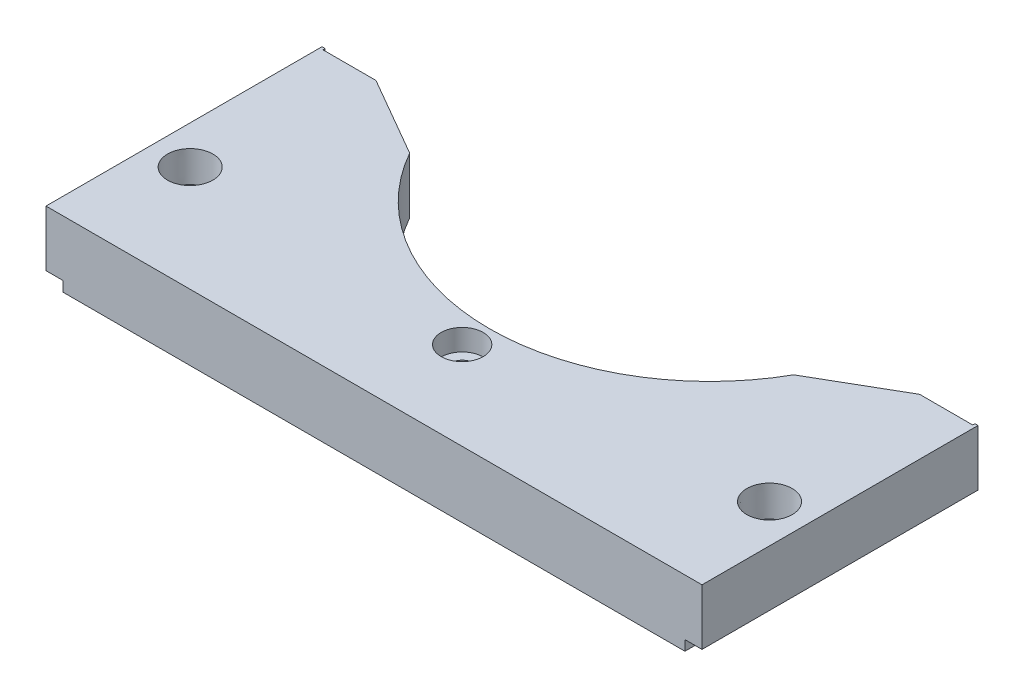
from build123d import *

# Parameters (mm, degrees)
SKETCH3_W                                       = 147.43505
SKETCH3_H                                       = 62.112
EXTRUDE1_DEPTH                                  = 12.7
EXTRUDE2_REACH                                  = 82.994
EXTRUDE6_START                                  = -12.7
EXTRUDE6_DEPTH                                  = 12.7
EXTRUDE4_DEPTH                                  = 2.3
EXTRUDE5_DEPTH                                  = 2.3
CBORE_FOR_10_SOCKET_HEAD_CAP_SCREW1_D           = 4.9784
CBORE_FOR_10_SOCKET_HEAD_CAP_SCREW1_CBORE_D     = 9.525
CBORE_FOR_10_SOCKET_HEAD_CAP_SCREW1_CBORE_DEPTH = 4.826
EXTRUDE7_DEPTH                                  = 1
EXTRUDE8_DEPTH                                  = 0.5
SKETCH14_W                                      = 62.612
SKETCH14_H                                      = 12.7
EXTRUDE10_DEPTH                                 = 0.7


with BuildPart() as part:
    # Sketch3 → Extrude1 (new body)
    with BuildSketch(Plane(origin=(0, 0, 0), x_dir=(1, 0, 0), z_dir=(0, 1, 0))):
        Rectangle(SKETCH3_W, SKETCH3_H)
    extrude(amount=EXTRUDE1_DEPTH)

    # Sketch4 → Extrude2 (cut, up to next)
    with BuildSketch(Plane(origin=(0, 12.7, 0), x_dir=(1, 0, 0), z_dir=(0, 1, 0)), mode=Mode.PRIVATE) as extrude2_sk1:
        with BuildLine():
            Line((-50, 45.1435), (50, 45.1435))
            ThreePointArc((50, 45.1435), (0, -4.8565), (-50, 45.1435))
        make_face()
    extrude2_tool1 = extrude(extrude2_sk1.sketch, amount=-EXTRUDE2_REACH, mode=Mode.PRIVATE) & part.part
    add(extrude2_tool1.solids().sort_by_distance((0, 12.7, -23.922841))[0], mode=Mode.SUBTRACT)

    # Sketch9 → Extrude6 (cut)
    with BuildSketch(Plane(origin=(0, 12.7, 0), x_dir=(1, 0, 0), z_dir=(0, 1, 0)).offset(EXTRUDE6_START)):
        Polygon((-61.673025, 31.056), (0, -4.550937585), (61.673025, 31.056), align=None)
    extrude(amount=EXTRUDE6_DEPTH, mode=Mode.SUBTRACT)

    # Sketch6 → Extrude4 (add)
    with BuildSketch(Plane.XZ):
        with BuildLine():
            Line((-70.542525, 31.056), (70.542525, 31.056))
            Line((70.542525, 31.056), (70.542525, -27.881))
            Line((70.542525, -27.881), (62.523763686, -27.881))
            Line((62.523763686, -27.881), (45.888455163, -18.276600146))
            ThreePointArc((45.888455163, -18.276600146), (0, 8.0315), (-45.888455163, -18.276600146))
            Line((-45.888455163, -18.276600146), (-62.523763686, -27.881))
            Line((-62.523763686, -27.881), (-70.542525, -27.881))
            Line((-70.542525, -27.881), (-70.542525, 31.056))
        make_face()
    extrude(amount=EXTRUDE4_DEPTH)

    # Sketch7 → Extrude5 (cut)
    with BuildSketch(Plane.XZ.offset(2.3)):
        with BuildLine():
            Line((47.625, 5.657), (47.625, -31.056))
            Line((47.625, -31.056), (53.975, -31.056))
            Line((53.975, -31.056), (53.975, 5.657))
            ThreePointArc((53.975, 5.657), (50.8, 8.832), (47.625, 5.657))
        make_face()
        with BuildLine():
            Line((-53.975, 5.657), (-53.975, -31.056))
            Line((-53.975, -31.056), (-47.625, -31.056))
            Line((-47.625, -31.056), (-47.625, 5.657))
            ThreePointArc((-47.625, 5.657), (-50.8, 8.832), (-53.975, 5.657))
        make_face()
    extrude(amount=-EXTRUDE5_DEPTH, mode=Mode.SUBTRACT)

    # CBORE for _10 Socket Head Cap Screw1 (through all)
    with Locations(Plane(origin=(0, 12.7, 11.056), x_dir=(0, 0, 1), z_dir=(0, 1, 0))):
        with Locations((0, 0)):
            CounterBoreHole(CBORE_FOR_10_SOCKET_HEAD_CAP_SCREW1_D / 2, CBORE_FOR_10_SOCKET_HEAD_CAP_SCREW1_CBORE_D / 2, CBORE_FOR_10_SOCKET_HEAD_CAP_SCREW1_CBORE_DEPTH)

    # Sketch10 → Extrude7 (cut)
    with BuildSketch(Plane(origin=(0, 0, -31.056), x_dir=(-1, 0, 0), z_dir=(0, 0, -1))):
        with BuildLine():
            Line((-70.746234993, 0), (-72.688815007, 0))
            Line((-72.688815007, 0), (-72.46706812, 6.35))
            ThreePointArc((-72.46706812, 6.35), (-71.717525, 7.073825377), (-70.96798188, 6.35))
            Line((-70.96798188, 6.35), (-70.746234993, 0))
        make_face()
    extrude7 = extrude(amount=-EXTRUDE7_DEPTH, mode=Mode.SUBTRACT)

    # Sketch11 → Extrude8 (cut)
    with BuildSketch(Plane(origin=(0, 0, -31.056), x_dir=(-1, 0, 0), z_dir=(0, 0, -1))):
        with BuildLine():
            Line((-68.323775, 11.9), (-67.066775, 11.9))
            ThreePointArc((-67.066775, 11.9), (-66.505508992, 11.667516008), (-66.273025, 11.10625))
            Line((-66.273025, 11.10625), (-66.273025, 10.5806))
            ThreePointArc((-66.273025, 10.5806), (-66.033178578, 9.737995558), (-65.385547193, 9.148010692))
            ThreePointArc((-65.385547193, 9.148010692), (-65.064261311, 8.855322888), (-64.945275, 8.437312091))
            Line((-64.945275, 8.437312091), (-64.945275, 4.262687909))
            ThreePointArc((-64.945275, 4.262687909), (-65.064261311, 3.844677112), (-65.385547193, 3.551989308))
            ThreePointArc((-65.385547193, 3.551989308), (-66.033178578, 2.962004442), (-66.273025, 2.1194))
            Line((-66.273025, 2.1194), (-66.273025, 1.59375))
            ThreePointArc((-66.273025, 1.59375), (-66.505508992, 1.032483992), (-67.066775, 0.8))
            Line((-67.066775, 0.8), (-68.323775, 0.8))
            ThreePointArc((-68.323775, 0.8), (-68.885041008, 1.032483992), (-69.117525, 1.59375))
            Line((-69.117525, 1.59375), (-69.117525, 2.1194))
            ThreePointArc((-69.117525, 2.1194), (-69.357371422, 2.962004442), (-70.005002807, 3.551989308))
            ThreePointArc((-70.005002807, 3.551989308), (-70.326288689, 3.844677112), (-70.445275, 4.262687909))
            Line((-70.445275, 4.262687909), (-70.445275, 8.437312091))
            ThreePointArc((-70.445275, 8.437312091), (-70.326288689, 8.855322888), (-70.005002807, 9.148010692))
            ThreePointArc((-70.005002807, 9.148010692), (-69.357371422, 9.737995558), (-69.117525, 10.5806))
            Line((-69.117525, 10.5806), (-69.117525, 11.10625))
            ThreePointArc((-69.117525, 11.10625), (-68.885041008, 11.667516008), (-68.323775, 11.9))
        make_face()
    extrude8 = extrude(amount=-EXTRUDE8_DEPTH, mode=Mode.SUBTRACT)

    # Sketch12 → 1_8 _0.125_ Diameter Hole1 (revolve, cut)
    with BuildSketch(Plane(origin=(67.693740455, 3.213167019, -30.556), x_dir=(0, 1, 0), z_dir=(1, 0, 0))):
        Polygon((0, 0), (0, 39.053866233), (1.5875, 38.1), (1.5875, 0), align=None)
    f_1_8_0_125_diameter_hole1 = revolve(axis=Axis((67.693740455, 3.213167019, -36.906), (0, 0, 1)), mode=Mode.SUBTRACT)

    # Sketch13 → 1_8 NPT Tapped Hole1 (revolve, cut)
    with BuildSketch(Plane(origin=(65.717525, 12.7, 7.044), x_dir=(0, 0, 1), z_dir=(1, 0, 0))):
        Polygon((0, 0), (0, 14.153468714), (4.2164, 11.62), (4.2164, 6.92), (4.936178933, 6.92), (5.143373, 0), align=None)
    f_1_8_npt_tapped_hole1 = revolve(axis=Axis((65.717525, 19.05, 7.044), (0, -1, 0)), mode=Mode.SUBTRACT)

    # Sketch14 → Extrude10 (add)
    with BuildSketch(Plane(origin=(73.717525, 0, 0), x_dir=(0, 0, -1), z_dir=(1, 0, 0))):
        with Locations((0.25, 6.35)):
            Rectangle(SKETCH14_W, SKETCH14_H)
    extrude10 = extrude(amount=EXTRUDE10_DEPTH)

    # Mirror1: Extrude7, Extrude8, 1_8 _0.125_ Diameter Hole1, 1_8 NPT Tapped Hole1, Extrude10 across plane
    add(extrude7.mirror(Plane(origin=(0, 0, 0), x_dir=(0, 0, 1), z_dir=(1, 0, 0))), mode=Mode.SUBTRACT)
    add(extrude8.mirror(Plane(origin=(0, 0, 0), x_dir=(0, 0, 1), z_dir=(1, 0, 0))), mode=Mode.SUBTRACT)
    add(f_1_8_0_125_diameter_hole1.mirror(Plane(origin=(0, 0, 0), x_dir=(0, 0, 1), z_dir=(1, 0, 0))), mode=Mode.SUBTRACT)
    add(f_1_8_npt_tapped_hole1.mirror(Plane(origin=(0, 0, 0), x_dir=(0, 0, 1), z_dir=(1, 0, 0))), mode=Mode.SUBTRACT)
    add(extrude10.mirror(Plane(origin=(0, 0, 0), x_dir=(0, 0, 1), z_dir=(1, 0, 0))))


solid = part.part
